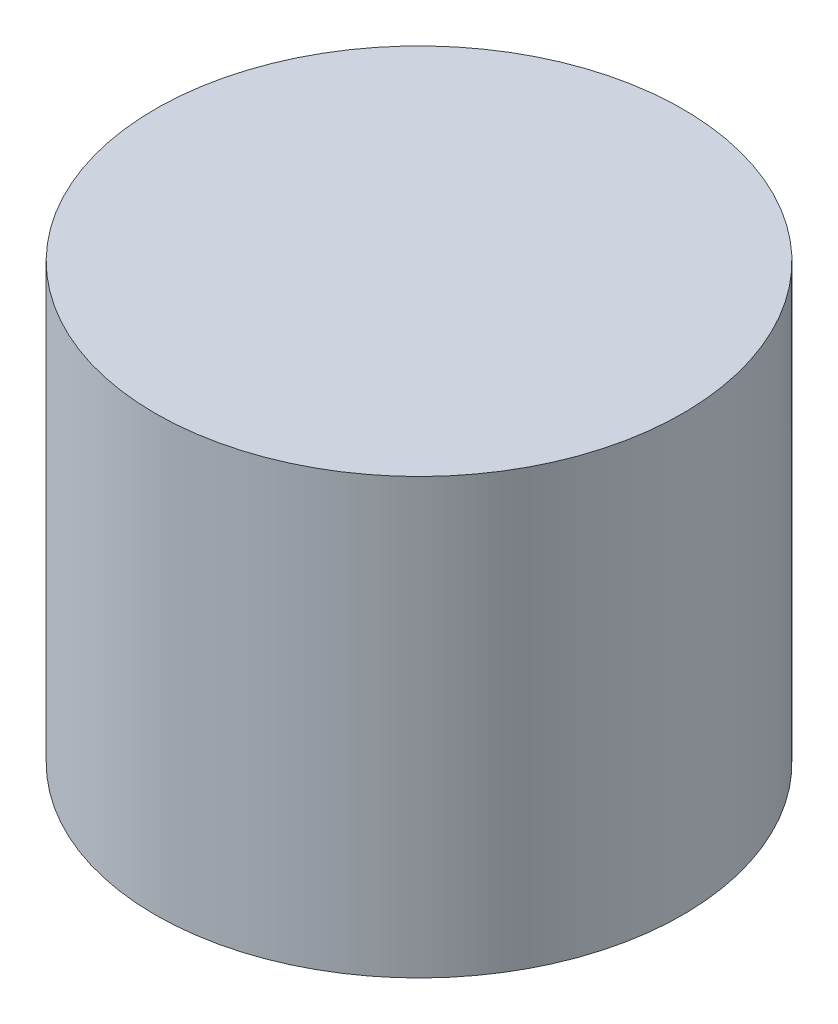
ISO-10303-21;
HEADER;
FILE_DESCRIPTION(('STEP AP214'),'2;1');
FILE_NAME('part.step','',(''),(''),'','','');
FILE_SCHEMA(('AUTOMOTIVE_DESIGN { 1 0 10303 214 1 1 1 1 }'));
ENDSEC;
DATA;
#1=APPLICATION_CONTEXT('core data for automotive mechanical design processes');
#2=APPLICATION_PROTOCOL_DEFINITION('international standard','automotive_design',2000,#1);
#3=PRODUCT_CONTEXT('',#1,'mechanical');
#4=PRODUCT('Part','Part','',(#3));
#5=PRODUCT_RELATED_PRODUCT_CATEGORY('part','',(#4));
#6=PRODUCT_DEFINITION_FORMATION('','',#4);
#7=PRODUCT_DEFINITION_CONTEXT('part definition',#1,'design');
#8=PRODUCT_DEFINITION('design','',#6,#7);
#9=PRODUCT_DEFINITION_SHAPE('','',#8);
#10=(LENGTH_UNIT() NAMED_UNIT(*) SI_UNIT(.MILLI.,.METRE.));
#11=(NAMED_UNIT(*) PLANE_ANGLE_UNIT() SI_UNIT($,.RADIAN.));
#12=(NAMED_UNIT(*) SI_UNIT($,.STERADIAN.) SOLID_ANGLE_UNIT());
#13=UNCERTAINTY_MEASURE_WITH_UNIT(LENGTH_MEASURE(1.E-05),#10,'distance_accuracy_value','');
#14=(GEOMETRIC_REPRESENTATION_CONTEXT(3) GLOBAL_UNCERTAINTY_ASSIGNED_CONTEXT((#13)) GLOBAL_UNIT_ASSIGNED_CONTEXT((#10,
#11,#12)) REPRESENTATION_CONTEXT('',''));
#15=CARTESIAN_POINT('',(0.,0.,0.));
#16=DIRECTION('',(0.,0.,1.));
#17=DIRECTION('',(1.,0.,0.));
#18=AXIS2_PLACEMENT_3D('',#15,#16,#17);
#19=CARTESIAN_POINT('',(-53.9999999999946,7.,28.0000000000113));
#20=DIRECTION('',(0.,-1.,0.));
#21=DIRECTION('',(0.,0.,-1.));
#22=AXIS2_PLACEMENT_3D('',#19,#20,#21);
#23=CYLINDRICAL_SURFACE('',#22,4.25);
#24=CARTESIAN_POINT('',(-53.9999999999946,7.,28.0000000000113));
#25=DIRECTION('',(0.,1.,0.));
#26=DIRECTION('',(0.,0.,1.));
#27=AXIS2_PLACEMENT_3D('',#24,#25,#26);
#28=CIRCLE('',#27,4.25);
#29=CARTESIAN_POINT('',(-53.9999999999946,7.,32.2500000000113));
#30=VERTEX_POINT('',#29);
#31=EDGE_CURVE('E10',#30,#30,#28,.T.);
#32=ORIENTED_EDGE('',*,*,#31,.F.);
#33=EDGE_LOOP('',(#32));
#34=FACE_BOUND('',#33,.T.);
#35=CARTESIAN_POINT('',(-53.9999999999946,0.,28.0000000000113));
#36=DIRECTION('',(0.,1.,0.));
#37=DIRECTION('',(0.,0.,1.));
#38=AXIS2_PLACEMENT_3D('',#35,#36,#37);
#39=CIRCLE('',#38,4.25);
#40=CARTESIAN_POINT('',(-53.9999999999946,0.,32.2500000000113));
#41=VERTEX_POINT('',#40);
#42=EDGE_CURVE('E33',#41,#41,#39,.T.);
#43=ORIENTED_EDGE('',*,*,#42,.T.);
#44=EDGE_LOOP('',(#43));
#45=FACE_BOUND('',#44,.T.);
#46=ADVANCED_FACE('F30',(#34,#45),#23,.T.);
#47=CARTESIAN_POINT('',(-53.9999999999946,7.,28.0000000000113));
#48=DIRECTION('',(0.,1.,0.));
#49=DIRECTION('',(0.,0.,1.));
#50=AXIS2_PLACEMENT_3D('',#47,#48,#49);
#51=PLANE('',#50);
#52=ORIENTED_EDGE('',*,*,#31,.T.);
#53=EDGE_LOOP('',(#52));
#54=FACE_BOUND('',#53,.T.);
#55=ADVANCED_FACE('F45',(#54),#51,.T.);
#56=CARTESIAN_POINT('',(-53.9999999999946,0.,28.0000000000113));
#57=DIRECTION('',(0.,1.,0.));
#58=DIRECTION('',(0.,0.,1.));
#59=AXIS2_PLACEMENT_3D('',#56,#57,#58);
#60=PLANE('',#59);
#61=ORIENTED_EDGE('',*,*,#42,.F.);
#62=EDGE_LOOP('',(#61));
#63=FACE_BOUND('',#62,.T.);
#64=ADVANCED_FACE('F43',(#63),#60,.F.);
#65=CLOSED_SHELL('',(#46,#55,#64));
#66=MANIFOLD_SOLID_BREP('B2',#65);
#67=ADVANCED_BREP_SHAPE_REPRESENTATION('',(#18,#66),#14);
#68=SHAPE_DEFINITION_REPRESENTATION(#9,#67);
ENDSEC;
END-ISO-10303-21;
